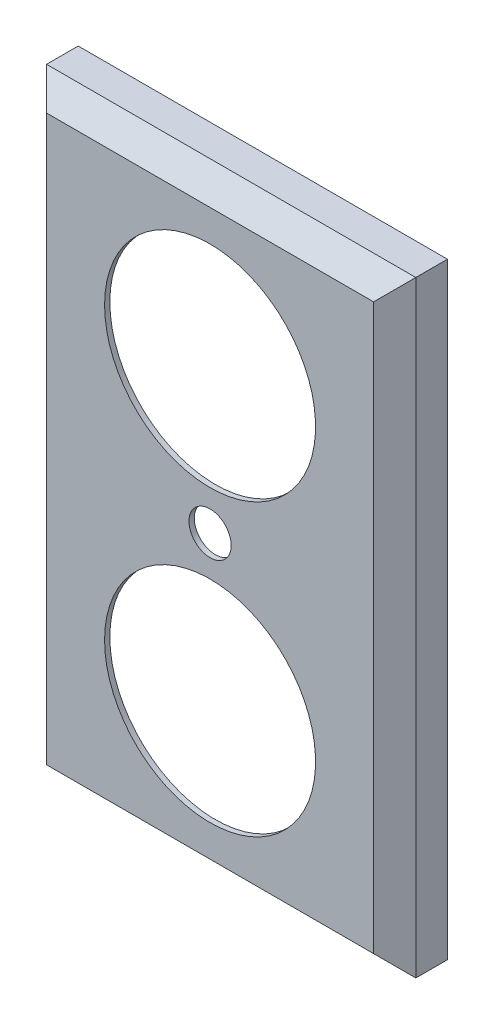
from build123d import *

# Parameters (mm, degrees)
SKETCH1_W          = 70
SKETCH1_H          = 115
BASE_EXTRUDE_DEPTH = 10
CHAMFER2_SIZE      = 4
SHELL1_T           = -1
SKETCH4_R          = 20
OUTLETCUT_DEPTH    = 136
SKETCH5_R          = 4
SCREWHOLE_DEPTH    = 136


with BuildPart() as part:
    # Sketch1 → Base-Extrude (new body)
    with BuildSketch(Plane.XY):
        with Locations((35, 57.5)):
            Rectangle(SKETCH1_W, SKETCH1_H)
    extrude(amount=BASE_EXTRUDE_DEPTH)

    # Chamfer2
    chamfer2_edges = [part.edges().sort_by_distance(p)[0] for p in [
        (70, 57.5, 10),
        (35, 115, 10),
        (0, 57.5, 10),
        (35, 0, 10),
    ]]
    chamfer(chamfer2_edges, length=CHAMFER2_SIZE)

    # Shell1
    shell1_openings = [part.faces().sort_by_distance(p)[0] for p in [
        (35, 57.5, 0),
    ]]
    offset(amount=SHELL1_T, openings=shell1_openings, kind=Kind.INTERSECTION)

    # Sketch4 → outletcut (cut, through all)
    with BuildSketch(Plane(origin=(0, 0, 0), x_dir=(-1, 0, 0), z_dir=(0, 0, -1))):
        with Locations((-35, 85)):
            Circle(SKETCH4_R)
        with Locations((-35, 30)):
            Circle(SKETCH4_R)
    extrude(amount=-OUTLETCUT_DEPTH, mode=Mode.SUBTRACT)

    # Sketch5 → screwhole (cut, through all)
    with BuildSketch(Plane.XY.offset(10)):
        with Locations((35, 57.5)):
            Circle(SKETCH5_R)
    extrude(amount=-SCREWHOLE_DEPTH, mode=Mode.SUBTRACT)


solid = part.part
